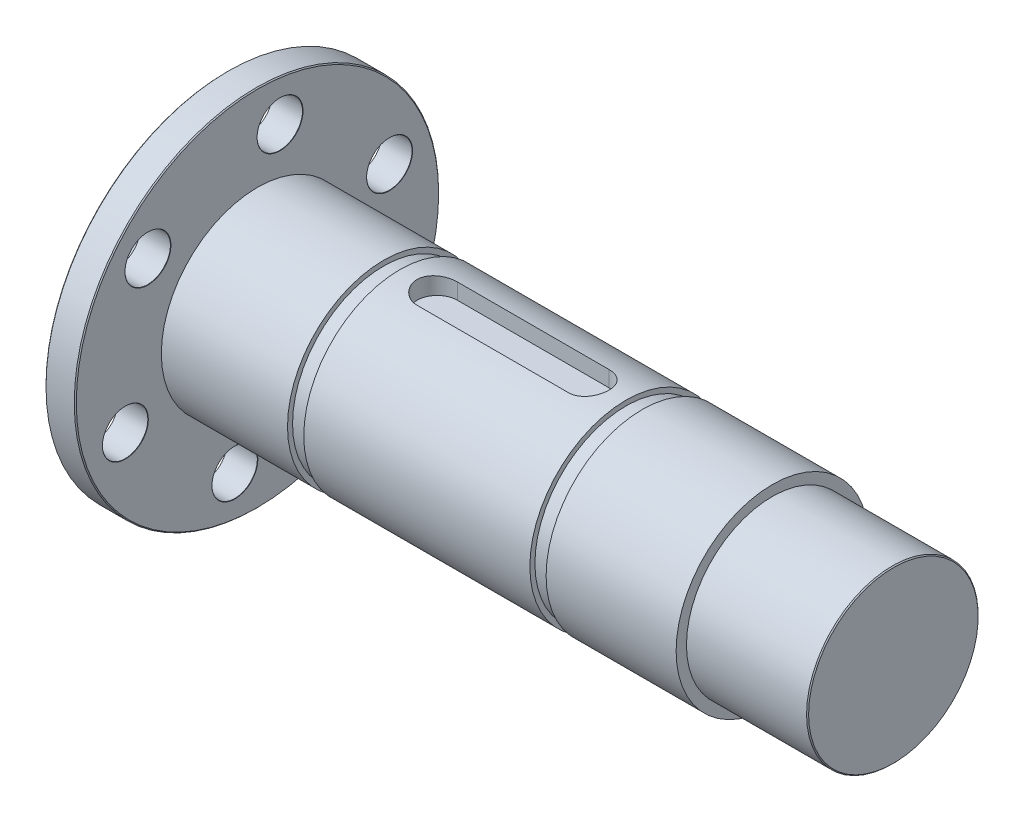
ISO-10303-21;
HEADER;
FILE_DESCRIPTION(('STEP AP214'),'2;1');
FILE_NAME('part.step','',(''),(''),'','','');
FILE_SCHEMA(('AUTOMOTIVE_DESIGN { 1 0 10303 214 1 1 1 1 }'));
ENDSEC;
DATA;
#1=APPLICATION_CONTEXT('core data for automotive mechanical design processes');
#2=APPLICATION_PROTOCOL_DEFINITION('international standard','automotive_design',2000,#1);
#3=PRODUCT_CONTEXT('',#1,'mechanical');
#4=PRODUCT('Part','Part','',(#3));
#5=PRODUCT_RELATED_PRODUCT_CATEGORY('part','',(#4));
#6=PRODUCT_DEFINITION_FORMATION('','',#4);
#7=PRODUCT_DEFINITION_CONTEXT('part definition',#1,'design');
#8=PRODUCT_DEFINITION('design','',#6,#7);
#9=PRODUCT_DEFINITION_SHAPE('','',#8);
#10=(LENGTH_UNIT() NAMED_UNIT(*) SI_UNIT(.MILLI.,.METRE.));
#11=(NAMED_UNIT(*) PLANE_ANGLE_UNIT() SI_UNIT($,.RADIAN.));
#12=(NAMED_UNIT(*) SI_UNIT($,.STERADIAN.) SOLID_ANGLE_UNIT());
#13=UNCERTAINTY_MEASURE_WITH_UNIT(LENGTH_MEASURE(1.E-05),#10,'distance_accuracy_value','');
#14=(GEOMETRIC_REPRESENTATION_CONTEXT(3) GLOBAL_UNCERTAINTY_ASSIGNED_CONTEXT((#13)) GLOBAL_UNIT_ASSIGNED_CONTEXT((#10,
#11,#12)) REPRESENTATION_CONTEXT('',''));
#15=CARTESIAN_POINT('',(0.,0.,0.));
#16=DIRECTION('',(0.,0.,1.));
#17=DIRECTION('',(1.,0.,0.));
#18=AXIS2_PLACEMENT_3D('',#15,#16,#17);
#19=CARTESIAN_POINT('',(42.9978723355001,13.5236372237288,0.));
#20=DIRECTION('',(-1.,0.,0.));
#21=DIRECTION('',(0.,0.,1.));
#22=AXIS2_PLACEMENT_3D('',#19,#20,#21);
#23=CYLINDRICAL_SURFACE('',#22,9.52418936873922);
#24=CARTESIAN_POINT('',(64.6078723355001,13.5236372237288,0.));
#25=DIRECTION('',(-1.,0.,0.));
#26=DIRECTION('',(0.,0.,1.));
#27=AXIS2_PLACEMENT_3D('',#24,#25,#26);
#28=CIRCLE('',#27,9.52418936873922);
#29=CARTESIAN_POINT('',(64.6078723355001,13.5236372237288,9.52418936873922));
#30=VERTEX_POINT('',#29);
#31=EDGE_CURVE('E224',#30,#30,#28,.T.);
#32=ORIENTED_EDGE('',*,*,#31,.F.);
#33=EDGE_LOOP('',(#32));
#34=FACE_BOUND('',#33,.T.);
#35=CARTESIAN_POINT('',(87.0078723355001,13.5236372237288,0.));
#36=DIRECTION('',(-1.,0.,0.));
#37=DIRECTION('',(0.,0.,1.));
#38=AXIS2_PLACEMENT_3D('',#35,#36,#37);
#39=CIRCLE('',#38,9.52418936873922);
#40=CARTESIAN_POINT('',(87.0078723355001,13.5236372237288,9.52418936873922));
#41=VERTEX_POINT('',#40);
#42=EDGE_CURVE('E228',#41,#41,#39,.T.);
#43=ORIENTED_EDGE('',*,*,#42,.T.);
#44=EDGE_LOOP('',(#43));
#45=FACE_BOUND('',#44,.T.);
#46=CARTESIAN_POINT('',(68.3076204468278,22.8354675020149,-2.));
#47=CARTESIAN_POINT('',(68.2520152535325,22.8354644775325,-2.00000036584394));
#48=CARTESIAN_POINT('',(68.1964373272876,22.8359662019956,-1.99767957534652));
#49=CARTESIAN_POINT('',(68.085691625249,22.8379476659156,-1.98842584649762));
#50=CARTESIAN_POINT('',(68.0305237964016,22.8394272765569,-1.98149351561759));
#51=CARTESIAN_POINT('',(67.8664195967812,22.8452762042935,-1.95386945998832));
#52=CARTESIAN_POINT('',(67.7586021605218,22.8510559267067,-1.9263503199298));
#53=CARTESIAN_POINT('',(67.5492495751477,22.8657123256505,-1.85395834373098));
#54=CARTESIAN_POINT('',(67.4477148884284,22.8745892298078,-1.80908423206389));
#55=CARTESIAN_POINT('',(67.2535805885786,22.8944351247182,-1.70329572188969));
#56=CARTESIAN_POINT('',(67.1609821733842,22.9054043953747,-1.64237917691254));
#57=CARTESIAN_POINT('',(66.9859568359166,22.9283876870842,-1.50523709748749));
#58=CARTESIAN_POINT('',(66.9036886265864,22.9404140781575,-1.42881113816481));
#59=CARTESIAN_POINT('',(66.7530327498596,22.9640491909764,-1.26324425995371));
#60=CARTESIAN_POINT('',(66.6846472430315,22.9756578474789,-1.17410136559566));
#61=CARTESIAN_POINT('',(66.5630814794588,22.9972835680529,-0.984570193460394));
#62=CARTESIAN_POINT('',(66.5100541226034,23.0072842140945,-0.88408181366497));
#63=CARTESIAN_POINT('',(66.4216999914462,23.0244261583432,-0.675381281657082));
#64=CARTESIAN_POINT('',(66.3863704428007,23.0315679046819,-0.567170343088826));
#65=CARTESIAN_POINT('',(66.3349112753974,23.0421000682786,-0.347752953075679));
#66=CARTESIAN_POINT('',(66.3185112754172,23.0455432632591,-0.23661248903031));
#67=CARTESIAN_POINT('',(66.3045321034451,23.0484729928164,-0.0131053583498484));
#68=CARTESIAN_POINT('',(66.3069513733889,23.0479598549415,0.0992612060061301));
#69=CARTESIAN_POINT('',(66.3303396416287,23.043075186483,0.320164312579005));
#70=CARTESIAN_POINT('',(66.3510168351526,23.0387643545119,0.428733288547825));
#71=CARTESIAN_POINT('',(66.4098698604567,23.0268375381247,0.640824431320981));
#72=CARTESIAN_POINT('',(66.4480463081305,23.0192214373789,0.744346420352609));
#73=CARTESIAN_POINT('',(66.5410786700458,23.0014409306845,0.944228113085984));
#74=CARTESIAN_POINT('',(66.5960472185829,22.9912594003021,1.0405338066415));
#75=CARTESIAN_POINT('',(66.7210182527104,22.9694677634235,1.22265838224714));
#76=CARTESIAN_POINT('',(66.7910221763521,22.9578575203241,1.30847625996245));
#77=CARTESIAN_POINT('',(66.9456610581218,22.9342258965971,1.4689164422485));
#78=CARTESIAN_POINT('',(67.0305497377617,22.9222008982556,1.54329383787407));
#79=CARTESIAN_POINT('',(67.2117453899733,22.8993006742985,1.67681926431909));
#80=CARTESIAN_POINT('',(67.3080554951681,22.8884257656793,1.7359631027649));
#81=CARTESIAN_POINT('',(67.5097494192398,22.8690466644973,1.83744200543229));
#82=CARTESIAN_POINT('',(67.6151604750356,22.8605499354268,1.87972432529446));
#83=CARTESIAN_POINT('',(67.8317442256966,22.8469962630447,1.94584630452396));
#84=CARTESIAN_POINT('',(67.9429080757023,22.8419341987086,1.96971342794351));
#85=CARTESIAN_POINT('',(68.0970825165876,22.8377519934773,1.98933824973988));
#86=CARTESIAN_POINT('',(68.1391226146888,22.8368963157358,1.99333767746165));
#87=CARTESIAN_POINT('',(68.2233089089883,22.8357545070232,1.99866525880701));
#88=CARTESIAN_POINT('',(68.2654548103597,22.8354674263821,1.99999786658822));
#89=CARTESIAN_POINT('',(68.3076204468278,22.8354675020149,2.));
#90=B_SPLINE_CURVE_WITH_KNOTS('',3,(#46,#47,#48,#49,#50,#51,#52,#53,#54,#55,#56,#57,#58,#59,#60,
#61,#62,#63,#64,#65,#66,#67,#68,#69,#70,#71,#72,#73,#74,#75,#76,#77,#78,#79,#80,#81,#82,#83,#84,
#85,#86,#87,#88,#89),.UNSPECIFIED.,.F.,.F.,(4,2,2,2,2,2,2,2,2,2,2,2,2,2,2,2,2,2,2,2,2,4),(0.,
0.166711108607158,0.333400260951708,0.665948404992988,0.998520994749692,1.33113810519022,
1.66836392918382,2.00564219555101,2.34617113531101,2.68664667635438,3.02219636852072,
3.35771828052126,3.68797290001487,4.01823914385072,4.35077121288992,4.68333510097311,
5.02224558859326,5.36124924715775,5.70130517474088,6.04085296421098,6.16750022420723,
6.29393577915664),.UNSPECIFIED.);
#91=CARTESIAN_POINT('',(68.3076204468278,22.8354675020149,-2.));
#92=VERTEX_POINT('',#91);
#93=CARTESIAN_POINT('',(68.3076204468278,22.8354675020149,2.));
#94=VERTEX_POINT('',#93);
#95=EDGE_CURVE('E72',#92,#94,#90,.T.);
#96=ORIENTED_EDGE('',*,*,#95,.F.);
#97=DIRECTION('',(-1.,0.,0.));
#98=VECTOR('',#97,1.);
#99=CARTESIAN_POINT('',(42.9978723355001,22.8354675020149,-2.));
#100=LINE('',#99,#98);
#101=CARTESIAN_POINT('',(83.3076204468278,22.8354675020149,-2.));
#102=VERTEX_POINT('',#101);
#103=EDGE_CURVE('E232',#102,#92,#100,.T.);
#104=ORIENTED_EDGE('',*,*,#103,.F.);
#105=CARTESIAN_POINT('',(83.3076204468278,22.8354675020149,2.));
#106=CARTESIAN_POINT('',(83.3632256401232,22.8354644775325,2.00000036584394));
#107=CARTESIAN_POINT('',(83.4188035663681,22.8359662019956,1.99767957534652));
#108=CARTESIAN_POINT('',(83.5295492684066,22.8379476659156,1.98842584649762));
#109=CARTESIAN_POINT('',(83.584717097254,22.8394272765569,1.98149351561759));
#110=CARTESIAN_POINT('',(83.7488212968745,22.8452762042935,1.95386945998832));
#111=CARTESIAN_POINT('',(83.8566387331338,22.8510559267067,1.9263503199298));
#112=CARTESIAN_POINT('',(84.065991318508,22.8657123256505,1.85395834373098));
#113=CARTESIAN_POINT('',(84.1675260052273,22.8745892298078,1.8090842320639));
#114=CARTESIAN_POINT('',(84.361660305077,22.8944351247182,1.70329572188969));
#115=CARTESIAN_POINT('',(84.4542587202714,22.9054043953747,1.64237917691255));
#116=CARTESIAN_POINT('',(84.629284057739,22.9283876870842,1.50523709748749));
#117=CARTESIAN_POINT('',(84.7115522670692,22.9404140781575,1.42881113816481));
#118=CARTESIAN_POINT('',(84.862208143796,22.9640491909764,1.26324425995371));
#119=CARTESIAN_POINT('',(84.9305936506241,22.9756578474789,1.17410136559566));
#120=CARTESIAN_POINT('',(85.0521594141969,22.9972835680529,0.984570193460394));
#121=CARTESIAN_POINT('',(85.1051867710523,23.0072842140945,0.88408181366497));
#122=CARTESIAN_POINT('',(85.1935409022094,23.0244261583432,0.675381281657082));
#123=CARTESIAN_POINT('',(85.228870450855,23.0315679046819,0.567170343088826));
#124=CARTESIAN_POINT('',(85.2803296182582,23.0421000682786,0.347752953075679));
#125=CARTESIAN_POINT('',(85.2967296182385,23.0455432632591,0.23661248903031));
#126=CARTESIAN_POINT('',(85.3107087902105,23.0484729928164,0.0131053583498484));
#127=CARTESIAN_POINT('',(85.3082895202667,23.0479598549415,-0.0992612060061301));
#128=CARTESIAN_POINT('',(85.284901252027,23.043075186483,-0.320164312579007));
#129=CARTESIAN_POINT('',(85.264224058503,23.0387643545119,-0.428733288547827));
#130=CARTESIAN_POINT('',(85.205371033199,23.0268375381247,-0.640824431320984));
#131=CARTESIAN_POINT('',(85.1671945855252,23.0192214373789,-0.744346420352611));
#132=CARTESIAN_POINT('',(85.0741622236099,23.0014409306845,-0.944228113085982));
#133=CARTESIAN_POINT('',(85.0191936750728,22.9912594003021,-1.04053380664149));
#134=CARTESIAN_POINT('',(84.8942226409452,22.9694677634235,-1.22265838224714));
#135=CARTESIAN_POINT('',(84.8242187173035,22.9578575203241,-1.30847625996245));
#136=CARTESIAN_POINT('',(84.6695798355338,22.9342258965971,-1.46891644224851));
#137=CARTESIAN_POINT('',(84.5846911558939,22.9222008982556,-1.54329383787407));
#138=CARTESIAN_POINT('',(84.4034955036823,22.8993006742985,-1.67681926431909));
#139=CARTESIAN_POINT('',(84.3071853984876,22.8884257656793,-1.7359631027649));
#140=CARTESIAN_POINT('',(84.1054914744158,22.8690466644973,-1.83744200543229));
#141=CARTESIAN_POINT('',(84.0000804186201,22.8605499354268,-1.87972432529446));
#142=CARTESIAN_POINT('',(83.783496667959,22.8469962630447,-1.94584630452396));
#143=CARTESIAN_POINT('',(83.6723328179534,22.8419341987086,-1.96971342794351));
#144=CARTESIAN_POINT('',(83.5181583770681,22.8377519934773,-1.98933824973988));
#145=CARTESIAN_POINT('',(83.4761182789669,22.8368963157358,-1.99333767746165));
#146=CARTESIAN_POINT('',(83.3919319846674,22.8357545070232,-1.99866525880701));
#147=CARTESIAN_POINT('',(83.349786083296,22.8354674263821,-1.99999786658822));
#148=CARTESIAN_POINT('',(83.3076204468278,22.8354675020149,-2.));
#149=B_SPLINE_CURVE_WITH_KNOTS('',3,(#105,#106,#107,#108,#109,#110,#111,#112,#113,#114,#115,
#116,#117,#118,#119,#120,#121,#122,#123,#124,#125,#126,#127,#128,#129,#130,#131,#132,#133,#134,
#135,#136,#137,#138,#139,#140,#141,#142,#143,#144,#145,#146,#147,#148),.UNSPECIFIED.,.F.,.F.,(4,
2,2,2,2,2,2,2,2,2,2,2,2,2,2,2,2,2,2,2,2,4),(0.,0.166711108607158,0.333400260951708,
0.665948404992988,0.998520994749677,1.33113810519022,1.66836392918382,2.00564219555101,
2.34617113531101,2.68664667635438,3.02219636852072,3.35771828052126,3.68797290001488,
4.01823914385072,4.35077121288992,4.68333510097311,5.02224558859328,5.36124924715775,
5.70130517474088,6.04085296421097,6.16750022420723,6.29393577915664),.UNSPECIFIED.);
#150=CARTESIAN_POINT('',(83.3076204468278,22.8354675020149,2.));
#151=VERTEX_POINT('',#150);
#152=EDGE_CURVE('E128',#151,#102,#149,.T.);
#153=ORIENTED_EDGE('',*,*,#152,.F.);
#154=DIRECTION('',(-1.,0.,0.));
#155=VECTOR('',#154,1.);
#156=CARTESIAN_POINT('',(42.9978723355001,22.8354675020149,2.));
#157=LINE('',#156,#155);
#158=EDGE_CURVE('E233',#94,#151,#157,.F.);
#159=ORIENTED_EDGE('',*,*,#158,.F.);
#160=EDGE_LOOP('',(#96,#104,#153,#159));
#161=FACE_BOUND('',#160,.T.);
#162=ADVANCED_FACE('F49',(#34,#45,#161),#23,.T.);
#163=CARTESIAN_POINT('',(42.9978723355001,0.,0.));
#164=DIRECTION('',(1.,0.,0.));
#165=DIRECTION('',(0.,0.,-1.));
#166=AXIS2_PLACEMENT_3D('',#163,#164,#165);
#167=PLANE('',#166);
#168=CARTESIAN_POINT('',(42.9978723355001,13.5236372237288,0.));
#169=DIRECTION('',(1.,0.,0.));
#170=DIRECTION('',(0.,0.,-1.));
#171=AXIS2_PLACEMENT_3D('',#168,#169,#170);
#172=CIRCLE('',#171,2.);
#173=CARTESIAN_POINT('',(42.9978723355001,13.5236372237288,-2.));
#174=VERTEX_POINT('',#173);
#175=EDGE_CURVE('E450',#174,#174,#172,.T.);
#176=ORIENTED_EDGE('',*,*,#175,.T.);
#177=EDGE_LOOP('',(#176));
#178=FACE_BOUND('',#177,.T.);
#179=CARTESIAN_POINT('',(42.9978723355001,13.5236372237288,0.));
#180=DIRECTION('',(-1.,0.,0.));
#181=DIRECTION('',(0.,0.,1.));
#182=AXIS2_PLACEMENT_3D('',#179,#180,#181);
#183=CIRCLE('',#182,10.5);
#184=CARTESIAN_POINT('',(42.9978723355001,13.5236372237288,10.5));
#185=VERTEX_POINT('',#184);
#186=EDGE_CURVE('E244',#185,#185,#183,.T.);
#187=ORIENTED_EDGE('',*,*,#186,.T.);
#188=EDGE_LOOP('',(#187));
#189=FACE_BOUND('',#188,.T.);
#190=ADVANCED_FACE('F212',(#178,#189),#167,.F.);
#191=CARTESIAN_POINT('',(42.9978723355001,13.5236372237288,0.));
#192=DIRECTION('',(-1.,0.,0.));
#193=DIRECTION('',(0.,0.,1.));
#194=AXIS2_PLACEMENT_3D('',#191,#192,#193);
#195=CYLINDRICAL_SURFACE('',#194,10.5);
#196=CARTESIAN_POINT('',(47.4978723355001,13.5236372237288,0.));
#197=DIRECTION('',(-1.,0.,0.));
#198=DIRECTION('',(0.,0.,1.));
#199=AXIS2_PLACEMENT_3D('',#196,#197,#198);
#200=CIRCLE('',#199,10.5);
#201=CARTESIAN_POINT('',(47.4978723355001,13.5236372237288,10.5));
#202=VERTEX_POINT('',#201);
#203=EDGE_CURVE('E404',#202,#202,#200,.T.);
#204=ORIENTED_EDGE('',*,*,#203,.T.);
#205=EDGE_LOOP('',(#204));
#206=FACE_BOUND('',#205,.T.);
#207=ORIENTED_EDGE('',*,*,#186,.F.);
#208=EDGE_LOOP('',(#207));
#209=FACE_BOUND('',#208,.T.);
#210=ADVANCED_FACE('F218',(#206,#209),#195,.T.);
#211=CARTESIAN_POINT('',(47.4978723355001,0.,0.));
#212=DIRECTION('',(-1.,0.,0.));
#213=DIRECTION('',(0.,0.,1.));
#214=AXIS2_PLACEMENT_3D('',#211,#212,#213);
#215=PLANE('',#214);
#216=CARTESIAN_POINT('',(47.4978723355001,22.3705459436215,10.850447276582));
#217=DIRECTION('',(-1.,0.,0.));
#218=DIRECTION('',(0.,0.,1.));
#219=AXIS2_PLACEMENT_3D('',#216,#217,#218);
#220=CIRCLE('',#219,2.24999999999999);
#221=CARTESIAN_POINT('',(47.4978723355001,22.3705459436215,13.100447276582));
#222=VERTEX_POINT('',#221);
#223=EDGE_CURVE('E54',#222,#222,#220,.T.);
#224=ORIENTED_EDGE('',*,*,#223,.F.);
#225=EDGE_LOOP('',(#224));
#226=FACE_BOUND('',#225,.T.);
#227=CARTESIAN_POINT('',(47.4978723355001,27.3438545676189,-2.23642405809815));
#228=DIRECTION('',(-1.,0.,0.));
#229=DIRECTION('',(0.,0.,1.));
#230=AXIS2_PLACEMENT_3D('',#227,#228,#229);
#231=CIRCLE('',#230,2.24999999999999);
#232=CARTESIAN_POINT('',(47.4978723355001,27.3438545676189,0.013575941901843));
#233=VERTEX_POINT('',#232);
#234=EDGE_CURVE('E279',#233,#233,#231,.T.);
#235=ORIENTED_EDGE('',*,*,#234,.F.);
#236=EDGE_LOOP('',(#235));
#237=FACE_BOUND('',#236,.T.);
#238=CARTESIAN_POINT('',(47.4978723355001,18.4969458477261,-13.0868713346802));
#239=DIRECTION('',(-1.,0.,0.));
#240=DIRECTION('',(0.,0.,1.));
#241=AXIS2_PLACEMENT_3D('',#238,#239,#240);
#242=CIRCLE('',#241,2.24999999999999);
#243=CARTESIAN_POINT('',(47.4978723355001,18.4969458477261,-10.8368713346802));
#244=VERTEX_POINT('',#243);
#245=EDGE_CURVE('E274',#244,#244,#242,.T.);
#246=ORIENTED_EDGE('',*,*,#245,.F.);
#247=EDGE_LOOP('',(#246));
#248=FACE_BOUND('',#247,.T.);
#249=CARTESIAN_POINT('',(47.4978723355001,4.67672850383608,-10.850447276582));
#250=DIRECTION('',(-1.,0.,0.));
#251=DIRECTION('',(0.,0.,1.));
#252=AXIS2_PLACEMENT_3D('',#249,#250,#251);
#253=CIRCLE('',#252,2.24999999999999);
#254=CARTESIAN_POINT('',(47.4978723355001,4.67672850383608,-8.60044727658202));
#255=VERTEX_POINT('',#254);
#256=EDGE_CURVE('E268',#255,#255,#253,.T.);
#257=ORIENTED_EDGE('',*,*,#256,.F.);
#258=EDGE_LOOP('',(#257));
#259=FACE_BOUND('',#258,.T.);
#260=CARTESIAN_POINT('',(47.4978723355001,-0.296580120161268,2.23642405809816));
#261=DIRECTION('',(-1.,0.,0.));
#262=DIRECTION('',(0.,0.,1.));
#263=AXIS2_PLACEMENT_3D('',#260,#261,#262);
#264=CIRCLE('',#263,2.24999999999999);
#265=CARTESIAN_POINT('',(47.4978723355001,-0.296580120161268,4.48642405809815));
#266=VERTEX_POINT('',#265);
#267=EDGE_CURVE('E262',#266,#266,#264,.T.);
#268=ORIENTED_EDGE('',*,*,#267,.F.);
#269=EDGE_LOOP('',(#268));
#270=FACE_BOUND('',#269,.T.);
#271=CARTESIAN_POINT('',(47.4978723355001,8.55032859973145,13.0868713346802));
#272=DIRECTION('',(-1.,0.,0.));
#273=DIRECTION('',(0.,0.,1.));
#274=AXIS2_PLACEMENT_3D('',#271,#272,#273);
#275=CIRCLE('',#274,2.24999999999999);
#276=CARTESIAN_POINT('',(47.4978723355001,8.55032859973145,15.3368713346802));
#277=VERTEX_POINT('',#276);
#278=EDGE_CURVE('E115',#277,#277,#275,.T.);
#279=ORIENTED_EDGE('',*,*,#278,.F.);
#280=EDGE_LOOP('',(#279));
#281=FACE_BOUND('',#280,.T.);
#282=CARTESIAN_POINT('',(47.4978723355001,13.5236372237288,0.));
#283=DIRECTION('',(-1.,0.,0.));
#284=DIRECTION('',(0.,0.,1.));
#285=AXIS2_PLACEMENT_3D('',#282,#283,#284);
#286=CIRCLE('',#285,17.95);
#287=CARTESIAN_POINT('',(47.4978723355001,13.5236372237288,17.95));
#288=VERTEX_POINT('',#287);
#289=EDGE_CURVE('E60',#288,#288,#286,.T.);
#290=ORIENTED_EDGE('',*,*,#289,.T.);
#291=EDGE_LOOP('',(#290));
#292=FACE_BOUND('',#291,.T.);
#293=ORIENTED_EDGE('',*,*,#203,.F.);
#294=EDGE_LOOP('',(#293));
#295=FACE_BOUND('',#294,.T.);
#296=ADVANCED_FACE('F386',(#226,#237,#248,#259,#270,#281,#292,#295),#215,.T.);
#297=CARTESIAN_POINT('',(42.9978723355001,13.5236372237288,0.));
#298=DIRECTION('',(-1.,0.,0.));
#299=DIRECTION('',(0.,0.,1.));
#300=AXIS2_PLACEMENT_3D('',#297,#298,#299);
#301=CYLINDRICAL_SURFACE('',#300,18.05);
#302=CARTESIAN_POINT('',(47.5978723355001,13.5236372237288,0.));
#303=DIRECTION('',(-1.,0.,0.));
#304=DIRECTION('',(0.,0.,1.));
#305=AXIS2_PLACEMENT_3D('',#302,#303,#304);
#306=CIRCLE('',#305,18.05);
#307=CARTESIAN_POINT('',(47.5978723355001,13.5236372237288,18.05));
#308=VERTEX_POINT('',#307);
#309=EDGE_CURVE('E11',#308,#308,#306,.F.);
#310=ORIENTED_EDGE('',*,*,#309,.T.);
#311=EDGE_LOOP('',(#310));
#312=FACE_BOUND('',#311,.T.);
#313=CARTESIAN_POINT('',(50.3978723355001,13.5236372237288,0.));
#314=DIRECTION('',(1.,0.,0.));
#315=DIRECTION('',(0.,0.,-1.));
#316=AXIS2_PLACEMENT_3D('',#313,#314,#315);
#317=CIRCLE('',#316,18.05);
#318=CARTESIAN_POINT('',(50.3978723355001,13.5236372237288,-18.05));
#319=VERTEX_POINT('',#318);
#320=EDGE_CURVE('E251',#319,#319,#317,.F.);
#321=ORIENTED_EDGE('',*,*,#320,.T.);
#322=EDGE_LOOP('',(#321));
#323=FACE_BOUND('',#322,.T.);
#324=ADVANCED_FACE('F389',(#312,#323),#301,.T.);
#325=CARTESIAN_POINT('',(50.4978723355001,0.,0.));
#326=DIRECTION('',(1.,0.,0.));
#327=DIRECTION('',(0.,0.,-1.));
#328=AXIS2_PLACEMENT_3D('',#325,#326,#327);
#329=PLANE('',#328);
#330=CARTESIAN_POINT('',(50.4978723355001,22.3705459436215,10.850447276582));
#331=DIRECTION('',(1.,0.,0.));
#332=DIRECTION('',(0.,0.,-1.));
#333=AXIS2_PLACEMENT_3D('',#330,#331,#332);
#334=CIRCLE('',#333,2.275);
#335=CARTESIAN_POINT('',(50.4978723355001,22.3705459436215,8.57544727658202));
#336=VERTEX_POINT('',#335);
#337=EDGE_CURVE('E376',#336,#336,#334,.T.);
#338=ORIENTED_EDGE('',*,*,#337,.F.);
#339=EDGE_LOOP('',(#338));
#340=FACE_BOUND('',#339,.T.);
#341=CARTESIAN_POINT('',(50.4978723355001,27.3438545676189,-2.23642405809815));
#342=DIRECTION('',(1.,0.,0.));
#343=DIRECTION('',(0.,0.,-1.));
#344=AXIS2_PLACEMENT_3D('',#341,#342,#343);
#345=CIRCLE('',#344,2.275);
#346=CARTESIAN_POINT('',(50.4978723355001,27.3438545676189,-4.51142405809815));
#347=VERTEX_POINT('',#346);
#348=EDGE_CURVE('E291',#347,#347,#345,.T.);
#349=ORIENTED_EDGE('',*,*,#348,.F.);
#350=EDGE_LOOP('',(#349));
#351=FACE_BOUND('',#350,.T.);
#352=CARTESIAN_POINT('',(50.4978723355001,18.4969458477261,-13.0868713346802));
#353=DIRECTION('',(1.,0.,0.));
#354=DIRECTION('',(0.,0.,-1.));
#355=AXIS2_PLACEMENT_3D('',#352,#353,#354);
#356=CIRCLE('',#355,2.275);
#357=CARTESIAN_POINT('',(50.4978723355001,18.4969458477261,-15.3618713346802));
#358=VERTEX_POINT('',#357);
#359=EDGE_CURVE('E282',#358,#358,#356,.T.);
#360=ORIENTED_EDGE('',*,*,#359,.F.);
#361=EDGE_LOOP('',(#360));
#362=FACE_BOUND('',#361,.T.);
#363=CARTESIAN_POINT('',(50.4978723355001,4.67672850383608,-10.850447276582));
#364=DIRECTION('',(1.,0.,0.));
#365=DIRECTION('',(0.,0.,-1.));
#366=AXIS2_PLACEMENT_3D('',#363,#364,#365);
#367=CIRCLE('',#366,2.275);
#368=CARTESIAN_POINT('',(50.4978723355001,4.67672850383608,-13.125447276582));
#369=VERTEX_POINT('',#368);
#370=EDGE_CURVE('E277',#369,#369,#367,.T.);
#371=ORIENTED_EDGE('',*,*,#370,.F.);
#372=EDGE_LOOP('',(#371));
#373=FACE_BOUND('',#372,.T.);
#374=CARTESIAN_POINT('',(50.4978723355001,-0.296580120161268,2.23642405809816));
#375=DIRECTION('',(1.,0.,0.));
#376=DIRECTION('',(0.,0.,-1.));
#377=AXIS2_PLACEMENT_3D('',#374,#375,#376);
#378=CIRCLE('',#377,2.275);
#379=CARTESIAN_POINT('',(50.4978723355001,-0.296580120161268,-0.0385759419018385));
#380=VERTEX_POINT('',#379);
#381=EDGE_CURVE('E272',#380,#380,#378,.T.);
#382=ORIENTED_EDGE('',*,*,#381,.F.);
#383=EDGE_LOOP('',(#382));
#384=FACE_BOUND('',#383,.T.);
#385=CARTESIAN_POINT('',(50.4978723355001,8.55032859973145,13.0868713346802));
#386=DIRECTION('',(1.,0.,0.));
#387=DIRECTION('',(0.,0.,-1.));
#388=AXIS2_PLACEMENT_3D('',#385,#386,#387);
#389=CIRCLE('',#388,2.275);
#390=CARTESIAN_POINT('',(50.4978723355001,8.55032859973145,10.8118713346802));
#391=VERTEX_POINT('',#390);
#392=EDGE_CURVE('E266',#391,#391,#389,.T.);
#393=ORIENTED_EDGE('',*,*,#392,.F.);
#394=EDGE_LOOP('',(#393));
#395=FACE_BOUND('',#394,.T.);
#396=CARTESIAN_POINT('',(50.4978723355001,13.5236372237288,0.));
#397=DIRECTION('',(1.,0.,0.));
#398=DIRECTION('',(0.,0.,-1.));
#399=AXIS2_PLACEMENT_3D('',#396,#397,#398);
#400=CIRCLE('',#399,17.95);
#401=CARTESIAN_POINT('',(50.4978723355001,13.5236372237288,-17.95));
#402=VERTEX_POINT('',#401);
#403=EDGE_CURVE('E255',#402,#402,#400,.T.);
#404=ORIENTED_EDGE('',*,*,#403,.T.);
#405=EDGE_LOOP('',(#404));
#406=FACE_BOUND('',#405,.T.);
#407=CARTESIAN_POINT('',(50.4978723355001,13.5236372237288,0.));
#408=DIRECTION('',(-1.,0.,0.));
#409=DIRECTION('',(0.,0.,1.));
#410=AXIS2_PLACEMENT_3D('',#407,#408,#409);
#411=CIRCLE('',#410,9.52418936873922);
#412=CARTESIAN_POINT('',(50.4978723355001,13.5236372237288,9.52418936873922));
#413=VERTEX_POINT('',#412);
#414=EDGE_CURVE('E407',#413,#413,#411,.T.);
#415=ORIENTED_EDGE('',*,*,#414,.T.);
#416=EDGE_LOOP('',(#415));
#417=FACE_BOUND('',#416,.T.);
#418=ADVANCED_FACE('F500',(#340,#351,#362,#373,#384,#395,#406,#417),#329,.T.);
#419=CARTESIAN_POINT('',(42.9978723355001,13.5236372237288,0.));
#420=DIRECTION('',(-1.,0.,0.));
#421=DIRECTION('',(0.,0.,1.));
#422=AXIS2_PLACEMENT_3D('',#419,#420,#421);
#423=CYLINDRICAL_SURFACE('',#422,9.52418936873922);
#424=ORIENTED_EDGE('',*,*,#414,.F.);
#425=EDGE_LOOP('',(#424));
#426=FACE_BOUND('',#425,.T.);
#427=CARTESIAN_POINT('',(62.9978723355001,13.5236372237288,0.));
#428=DIRECTION('',(-1.,0.,0.));
#429=DIRECTION('',(0.,0.,1.));
#430=AXIS2_PLACEMENT_3D('',#427,#428,#429);
#431=CIRCLE('',#430,9.52418936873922);
#432=CARTESIAN_POINT('',(62.9978723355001,13.5236372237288,9.52418936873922));
#433=VERTEX_POINT('',#432);
#434=EDGE_CURVE('E413',#433,#433,#431,.T.);
#435=ORIENTED_EDGE('',*,*,#434,.T.);
#436=EDGE_LOOP('',(#435));
#437=FACE_BOUND('',#436,.T.);
#438=ADVANCED_FACE('F505',(#426,#437),#423,.T.);
#439=CARTESIAN_POINT('',(62.9978723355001,0.,0.));
#440=DIRECTION('',(-1.,0.,0.));
#441=DIRECTION('',(0.,0.,1.));
#442=AXIS2_PLACEMENT_3D('',#439,#440,#441);
#443=PLANE('',#442);
#444=ORIENTED_EDGE('',*,*,#434,.F.);
#445=EDGE_LOOP('',(#444));
#446=FACE_BOUND('',#445,.T.);
#447=CARTESIAN_POINT('',(62.9978723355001,13.5236372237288,0.));
#448=DIRECTION('',(-1.,0.,0.));
#449=DIRECTION('',(0.,0.,1.));
#450=AXIS2_PLACEMENT_3D('',#447,#448,#449);
#451=CIRCLE('',#450,9.02418936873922);
#452=CARTESIAN_POINT('',(62.9978723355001,13.5236372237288,9.02418936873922));
#453=VERTEX_POINT('',#452);
#454=EDGE_CURVE('E419',#453,#453,#451,.T.);
#455=ORIENTED_EDGE('',*,*,#454,.T.);
#456=EDGE_LOOP('',(#455));
#457=FACE_BOUND('',#456,.T.);
#458=ADVANCED_FACE('F509',(#446,#457),#443,.F.);
#459=CARTESIAN_POINT('',(42.9978723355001,13.5236372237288,0.));
#460=DIRECTION('',(-1.,0.,0.));
#461=DIRECTION('',(0.,0.,1.));
#462=AXIS2_PLACEMENT_3D('',#459,#460,#461);
#463=CYLINDRICAL_SURFACE('',#462,9.02418936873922);
#464=ORIENTED_EDGE('',*,*,#454,.F.);
#465=EDGE_LOOP('',(#464));
#466=FACE_BOUND('',#465,.T.);
#467=CARTESIAN_POINT('',(64.6078723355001,13.5236372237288,0.));
#468=DIRECTION('',(-1.,0.,0.));
#469=DIRECTION('',(0.,0.,1.));
#470=AXIS2_PLACEMENT_3D('',#467,#468,#469);
#471=CIRCLE('',#470,9.02418936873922);
#472=CARTESIAN_POINT('',(64.6078723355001,13.5236372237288,9.02418936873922));
#473=VERTEX_POINT('',#472);
#474=EDGE_CURVE('E423',#473,#473,#471,.T.);
#475=ORIENTED_EDGE('',*,*,#474,.T.);
#476=EDGE_LOOP('',(#475));
#477=FACE_BOUND('',#476,.T.);
#478=ADVANCED_FACE('F207',(#466,#477),#463,.T.);
#479=CARTESIAN_POINT('',(64.6078723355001,1.79322868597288E-12,0.));
#480=DIRECTION('',(1.,0.,0.));
#481=DIRECTION('',(0.,0.,-1.));
#482=AXIS2_PLACEMENT_3D('',#479,#480,#481);
#483=PLANE('',#482);
#484=ORIENTED_EDGE('',*,*,#474,.F.);
#485=EDGE_LOOP('',(#484));
#486=FACE_BOUND('',#485,.T.);
#487=ORIENTED_EDGE('',*,*,#31,.T.);
#488=EDGE_LOOP('',(#487));
#489=FACE_BOUND('',#488,.T.);
#490=ADVANCED_FACE('F202',(#486,#489),#483,.F.);
#491=CARTESIAN_POINT('',(87.0078723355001,0.,0.));
#492=DIRECTION('',(1.,0.,0.));
#493=DIRECTION('',(0.,0.,-1.));
#494=AXIS2_PLACEMENT_3D('',#491,#492,#493);
#495=PLANE('',#494);
#496=CARTESIAN_POINT('',(87.0078723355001,13.5236372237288,0.));
#497=DIRECTION('',(-1.,0.,0.));
#498=DIRECTION('',(0.,0.,1.));
#499=AXIS2_PLACEMENT_3D('',#496,#497,#498);
#500=CIRCLE('',#499,9.02418936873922);
#501=CARTESIAN_POINT('',(87.0078723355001,13.5236372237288,9.02418936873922));
#502=VERTEX_POINT('',#501);
#503=EDGE_CURVE('E431',#502,#502,#500,.T.);
#504=ORIENTED_EDGE('',*,*,#503,.T.);
#505=EDGE_LOOP('',(#504));
#506=FACE_BOUND('',#505,.T.);
#507=ORIENTED_EDGE('',*,*,#42,.F.);
#508=EDGE_LOOP('',(#507));
#509=FACE_BOUND('',#508,.T.);
#510=ADVANCED_FACE('F199',(#506,#509),#495,.T.);
#511=CARTESIAN_POINT('',(42.9978723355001,13.5236372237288,0.));
#512=DIRECTION('',(-1.,0.,0.));
#513=DIRECTION('',(0.,0.,1.));
#514=AXIS2_PLACEMENT_3D('',#511,#512,#513);
#515=CYLINDRICAL_SURFACE('',#514,9.02418936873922);
#516=CARTESIAN_POINT('',(88.6178723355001,13.5236372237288,0.));
#517=DIRECTION('',(-1.,0.,0.));
#518=DIRECTION('',(0.,0.,1.));
#519=AXIS2_PLACEMENT_3D('',#516,#517,#518);
#520=CIRCLE('',#519,9.02418936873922);
#521=CARTESIAN_POINT('',(88.6178723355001,13.5236372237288,9.02418936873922));
#522=VERTEX_POINT('',#521);
#523=EDGE_CURVE('E434',#522,#522,#520,.T.);
#524=ORIENTED_EDGE('',*,*,#523,.T.);
#525=EDGE_LOOP('',(#524));
#526=FACE_BOUND('',#525,.T.);
#527=ORIENTED_EDGE('',*,*,#503,.F.);
#528=EDGE_LOOP('',(#527));
#529=FACE_BOUND('',#528,.T.);
#530=ADVANCED_FACE('F196',(#526,#529),#515,.T.);
#531=CARTESIAN_POINT('',(88.6178723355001,0.,0.));
#532=DIRECTION('',(-1.,0.,0.));
#533=DIRECTION('',(0.,0.,1.));
#534=AXIS2_PLACEMENT_3D('',#531,#532,#533);
#535=PLANE('',#534);
#536=CARTESIAN_POINT('',(88.6178723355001,13.5236372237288,0.));
#537=DIRECTION('',(-1.,0.,0.));
#538=DIRECTION('',(0.,0.,1.));
#539=AXIS2_PLACEMENT_3D('',#536,#537,#538);
#540=CIRCLE('',#539,9.52418936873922);
#541=CARTESIAN_POINT('',(88.6178723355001,13.5236372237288,9.52418936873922));
#542=VERTEX_POINT('',#541);
#543=EDGE_CURVE('E438',#542,#542,#540,.T.);
#544=ORIENTED_EDGE('',*,*,#543,.T.);
#545=EDGE_LOOP('',(#544));
#546=FACE_BOUND('',#545,.T.);
#547=ORIENTED_EDGE('',*,*,#523,.F.);
#548=EDGE_LOOP('',(#547));
#549=FACE_BOUND('',#548,.T.);
#550=ADVANCED_FACE('F192',(#546,#549),#535,.T.);
#551=CARTESIAN_POINT('',(42.9978723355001,13.5236372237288,0.));
#552=DIRECTION('',(-1.,0.,0.));
#553=DIRECTION('',(0.,0.,1.));
#554=AXIS2_PLACEMENT_3D('',#551,#552,#553);
#555=CYLINDRICAL_SURFACE('',#554,9.52418936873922);
#556=CARTESIAN_POINT('',(101.4978723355,13.5236372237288,0.));
#557=DIRECTION('',(-1.,0.,0.));
#558=DIRECTION('',(0.,0.,1.));
#559=AXIS2_PLACEMENT_3D('',#556,#557,#558);
#560=CIRCLE('',#559,9.52418936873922);
#561=CARTESIAN_POINT('',(101.4978723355,13.5236372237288,9.52418936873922));
#562=VERTEX_POINT('',#561);
#563=EDGE_CURVE('E442',#562,#562,#560,.T.);
#564=ORIENTED_EDGE('',*,*,#563,.T.);
#565=EDGE_LOOP('',(#564));
#566=FACE_BOUND('',#565,.T.);
#567=ORIENTED_EDGE('',*,*,#543,.F.);
#568=EDGE_LOOP('',(#567));
#569=FACE_BOUND('',#568,.T.);
#570=ADVANCED_FACE('F188',(#566,#569),#555,.T.);
#571=CARTESIAN_POINT('',(101.4978723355,0.,0.));
#572=DIRECTION('',(1.,0.,0.));
#573=DIRECTION('',(0.,0.,-1.));
#574=AXIS2_PLACEMENT_3D('',#571,#572,#573);
#575=PLANE('',#574);
#576=CARTESIAN_POINT('',(101.4978723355,13.5236372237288,0.));
#577=DIRECTION('',(-1.,0.,0.));
#578=DIRECTION('',(0.,0.,1.));
#579=AXIS2_PLACEMENT_3D('',#576,#577,#578);
#580=CIRCLE('',#579,8.5);
#581=CARTESIAN_POINT('',(101.4978723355,13.5236372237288,8.5));
#582=VERTEX_POINT('',#581);
#583=EDGE_CURVE('E446',#582,#582,#580,.T.);
#584=ORIENTED_EDGE('',*,*,#583,.T.);
#585=EDGE_LOOP('',(#584));
#586=FACE_BOUND('',#585,.T.);
#587=ORIENTED_EDGE('',*,*,#563,.F.);
#588=EDGE_LOOP('',(#587));
#589=FACE_BOUND('',#588,.T.);
#590=ADVANCED_FACE('F184',(#586,#589),#575,.T.);
#591=CARTESIAN_POINT('',(42.9978723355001,13.5236372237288,0.));
#592=DIRECTION('',(-1.,0.,0.));
#593=DIRECTION('',(0.,0.,1.));
#594=AXIS2_PLACEMENT_3D('',#591,#592,#593);
#595=CYLINDRICAL_SURFACE('',#594,8.5);
#596=CARTESIAN_POINT('',(113.3978723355,13.5236372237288,0.));
#597=DIRECTION('',(-1.,0.,0.));
#598=DIRECTION('',(0.,0.,1.));
#599=AXIS2_PLACEMENT_3D('',#596,#597,#598);
#600=CIRCLE('',#599,8.5);
#601=CARTESIAN_POINT('',(113.3978723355,13.5236372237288,8.5));
#602=VERTEX_POINT('',#601);
#603=EDGE_CURVE('E237',#602,#602,#600,.T.);
#604=ORIENTED_EDGE('',*,*,#603,.T.);
#605=EDGE_LOOP('',(#604));
#606=FACE_BOUND('',#605,.T.);
#607=ORIENTED_EDGE('',*,*,#583,.F.);
#608=EDGE_LOOP('',(#607));
#609=FACE_BOUND('',#608,.T.);
#610=ADVANCED_FACE('F180',(#606,#609),#595,.T.);
#611=CARTESIAN_POINT('',(113.4978723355,0.,0.));
#612=DIRECTION('',(-1.,0.,0.));
#613=DIRECTION('',(0.,0.,1.));
#614=AXIS2_PLACEMENT_3D('',#611,#612,#613);
#615=PLANE('',#614);
#616=CARTESIAN_POINT('',(113.4978723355,13.5236372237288,0.));
#617=DIRECTION('',(-1.,0.,0.));
#618=DIRECTION('',(0.,0.,1.));
#619=AXIS2_PLACEMENT_3D('',#616,#617,#618);
#620=CIRCLE('',#619,8.39999999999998);
#621=CARTESIAN_POINT('',(113.4978723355,13.5236372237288,8.39999999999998));
#622=VERTEX_POINT('',#621);
#623=EDGE_CURVE('E242',#622,#622,#620,.F.);
#624=ORIENTED_EDGE('',*,*,#623,.T.);
#625=EDGE_LOOP('',(#624));
#626=FACE_BOUND('',#625,.T.);
#627=ADVANCED_FACE('F176',(#626),#615,.F.);
#628=CARTESIAN_POINT('',(50.4978723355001,15.5486372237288,0.));
#629=DIRECTION('',(1.,0.,0.));
#630=DIRECTION('',(0.,0.,-1.));
#631=AXIS2_PLACEMENT_3D('',#628,#629,#630);
#632=PLANE('',#631);
#633=CARTESIAN_POINT('',(50.4978723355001,13.5236372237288,0.));
#634=DIRECTION('',(1.,0.,0.));
#635=DIRECTION('',(0.,0.,-1.));
#636=AXIS2_PLACEMENT_3D('',#633,#634,#635);
#637=CIRCLE('',#636,2.025);
#638=CARTESIAN_POINT('',(50.4978723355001,13.5236372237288,-2.025));
#639=VERTEX_POINT('',#638);
#640=EDGE_CURVE('E458',#639,#639,#637,.T.);
#641=ORIENTED_EDGE('',*,*,#640,.F.);
#642=EDGE_LOOP('',(#641));
#643=FACE_BOUND('',#642,.T.);
#644=ADVANCED_FACE('F172',(#643),#632,.F.);
#645=CARTESIAN_POINT('',(50.4978723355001,13.5236372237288,0.));
#646=DIRECTION('',(1.,0.,0.));
#647=DIRECTION('',(0.,0.,-1.));
#648=AXIS2_PLACEMENT_3D('',#645,#646,#647);
#649=CYLINDRICAL_SURFACE('',#648,2.);
#650=ORIENTED_EDGE('',*,*,#175,.F.);
#651=EDGE_LOOP('',(#650));
#652=FACE_BOUND('',#651,.T.);
#653=CARTESIAN_POINT('',(50.4728723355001,13.5236372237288,0.));
#654=DIRECTION('',(1.,0.,0.));
#655=DIRECTION('',(0.,0.,-1.));
#656=AXIS2_PLACEMENT_3D('',#653,#654,#655);
#657=CIRCLE('',#656,2.);
#658=CARTESIAN_POINT('',(50.4728723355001,13.5236372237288,-2.));
#659=VERTEX_POINT('',#658);
#660=EDGE_CURVE('E454',#659,#659,#657,.T.);
#661=ORIENTED_EDGE('',*,*,#660,.T.);
#662=EDGE_LOOP('',(#661));
#663=FACE_BOUND('',#662,.T.);
#664=ADVANCED_FACE('F168',(#652,#663),#649,.F.);
#665=CARTESIAN_POINT('',(50.4978723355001,13.5236372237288,0.));
#666=DIRECTION('',(1.,0.,0.));
#667=DIRECTION('',(0.,0.,-1.));
#668=AXIS2_PLACEMENT_3D('',#665,#666,#667);
#669=CONICAL_SURFACE('',#668,2.025,0.785398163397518);
#670=ORIENTED_EDGE('',*,*,#660,.F.);
#671=EDGE_LOOP('',(#670));
#672=FACE_BOUND('',#671,.T.);
#673=ORIENTED_EDGE('',*,*,#640,.T.);
#674=EDGE_LOOP('',(#673));
#675=FACE_BOUND('',#674,.T.);
#676=ADVANCED_FACE('F164',(#672,#675),#669,.F.);
#677=CARTESIAN_POINT('',(83.3076204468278,21.4232044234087,-2.));
#678=DIRECTION('',(0.,0.,1.));
#679=DIRECTION('',(1.,0.,0.));
#680=AXIS2_PLACEMENT_3D('',#677,#678,#679);
#681=PLANE('',#680);
#682=ORIENTED_EDGE('',*,*,#103,.T.);
#683=DIRECTION('',(0.,1.,0.));
#684=VECTOR('',#683,1.);
#685=CARTESIAN_POINT('',(68.3076204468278,21.4232044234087,-2.));
#686=LINE('',#685,#684);
#687=CARTESIAN_POINT('',(68.3076204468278,21.2632044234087,-2.));
#688=VERTEX_POINT('',#687);
#689=EDGE_CURVE('E68',#688,#92,#686,.T.);
#690=ORIENTED_EDGE('',*,*,#689,.F.);
#691=DIRECTION('',(-1.,0.,0.));
#692=VECTOR('',#691,1.);
#693=CARTESIAN_POINT('',(68.3076204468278,21.2632044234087,-2.));
#694=LINE('',#693,#692);
#695=CARTESIAN_POINT('',(83.3076204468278,21.2632044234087,-2.));
#696=VERTEX_POINT('',#695);
#697=EDGE_CURVE('E113',#696,#688,#694,.T.);
#698=ORIENTED_EDGE('',*,*,#697,.F.);
#699=DIRECTION('',(0.,1.,0.));
#700=VECTOR('',#699,1.);
#701=CARTESIAN_POINT('',(83.3076204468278,21.4232044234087,-2.));
#702=LINE('',#701,#700);
#703=EDGE_CURVE('E98',#696,#102,#702,.T.);
#704=ORIENTED_EDGE('',*,*,#703,.T.);
#705=EDGE_LOOP('',(#682,#690,#698,#704));
#706=FACE_BOUND('',#705,.T.);
#707=ADVANCED_FACE('F161',(#706),#681,.T.);
#708=CARTESIAN_POINT('',(83.3076204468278,21.4232044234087,2.));
#709=DIRECTION('',(0.,0.,-1.));
#710=DIRECTION('',(-1.,0.,0.));
#711=AXIS2_PLACEMENT_3D('',#708,#709,#710);
#712=PLANE('',#711);
#713=ORIENTED_EDGE('',*,*,#158,.T.);
#714=DIRECTION('',(0.,-1.,0.));
#715=VECTOR('',#714,1.);
#716=CARTESIAN_POINT('',(83.3076204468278,21.4232044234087,2.));
#717=LINE('',#716,#715);
#718=CARTESIAN_POINT('',(83.3076204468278,21.2632044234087,2.));
#719=VERTEX_POINT('',#718);
#720=EDGE_CURVE('E103',#151,#719,#717,.T.);
#721=ORIENTED_EDGE('',*,*,#720,.T.);
#722=DIRECTION('',(1.,0.,0.));
#723=VECTOR('',#722,1.);
#724=CARTESIAN_POINT('',(68.3076204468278,21.2632044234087,2.));
#725=LINE('',#724,#723);
#726=CARTESIAN_POINT('',(68.3076204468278,21.2632044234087,2.));
#727=VERTEX_POINT('',#726);
#728=EDGE_CURVE('E101',#727,#719,#725,.T.);
#729=ORIENTED_EDGE('',*,*,#728,.F.);
#730=DIRECTION('',(0.,-1.,0.));
#731=VECTOR('',#730,1.);
#732=CARTESIAN_POINT('',(68.3076204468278,21.4232044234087,2.));
#733=LINE('',#732,#731);
#734=EDGE_CURVE('E89',#94,#727,#733,.T.);
#735=ORIENTED_EDGE('',*,*,#734,.F.);
#736=EDGE_LOOP('',(#713,#721,#729,#735));
#737=FACE_BOUND('',#736,.T.);
#738=ADVANCED_FACE('F102',(#737),#712,.T.);
#739=CARTESIAN_POINT('',(113.3978723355,13.5236372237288,0.));
#740=DIRECTION('',(-1.,0.,0.));
#741=DIRECTION('',(0.,0.,1.));
#742=AXIS2_PLACEMENT_3D('',#739,#740,#741);
#743=CONICAL_SURFACE('',#742,8.5,0.785398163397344);
#744=ORIENTED_EDGE('',*,*,#623,.F.);
#745=EDGE_LOOP('',(#744));
#746=FACE_BOUND('',#745,.T.);
#747=ORIENTED_EDGE('',*,*,#603,.F.);
#748=EDGE_LOOP('',(#747));
#749=FACE_BOUND('',#748,.T.);
#750=ADVANCED_FACE('F160',(#746,#749),#743,.T.);
#751=CARTESIAN_POINT('',(50.3978723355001,13.5236372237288,0.));
#752=DIRECTION('',(-1.,0.,0.));
#753=DIRECTION('',(0.,0.,1.));
#754=AXIS2_PLACEMENT_3D('',#751,#752,#753);
#755=CONICAL_SURFACE('',#754,18.05,0.785398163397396);
#756=ORIENTED_EDGE('',*,*,#403,.F.);
#757=EDGE_LOOP('',(#756));
#758=FACE_BOUND('',#757,.T.);
#759=ORIENTED_EDGE('',*,*,#320,.F.);
#760=EDGE_LOOP('',(#759));
#761=FACE_BOUND('',#760,.T.);
#762=ADVANCED_FACE('F486',(#758,#761),#755,.T.);
#763=CARTESIAN_POINT('',(47.4978723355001,13.5236372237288,0.));
#764=DIRECTION('',(1.,0.,0.));
#765=DIRECTION('',(0.,0.,-1.));
#766=AXIS2_PLACEMENT_3D('',#763,#764,#765);
#767=CONICAL_SURFACE('',#766,17.95,0.785398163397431);
#768=ORIENTED_EDGE('',*,*,#309,.F.);
#769=EDGE_LOOP('',(#768));
#770=FACE_BOUND('',#769,.T.);
#771=ORIENTED_EDGE('',*,*,#289,.F.);
#772=EDGE_LOOP('',(#771));
#773=FACE_BOUND('',#772,.T.);
#774=ADVANCED_FACE('F52',(#770,#773),#767,.T.);
#775=CARTESIAN_POINT('',(68.3076204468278,23.1632044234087,0.));
#776=DIRECTION('',(0.,-1.,0.));
#777=DIRECTION('',(0.,0.,-1.));
#778=AXIS2_PLACEMENT_3D('',#775,#776,#777);
#779=CYLINDRICAL_SURFACE('',#778,2.);
#780=ORIENTED_EDGE('',*,*,#95,.T.);
#781=ORIENTED_EDGE('',*,*,#734,.T.);
#782=CARTESIAN_POINT('',(68.3076204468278,21.2632044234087,0.));
#783=DIRECTION('',(0.,1.,0.));
#784=DIRECTION('',(0.,0.,1.));
#785=AXIS2_PLACEMENT_3D('',#782,#783,#784);
#786=CIRCLE('',#785,2.);
#787=EDGE_CURVE('E93',#688,#727,#786,.T.);
#788=ORIENTED_EDGE('',*,*,#787,.F.);
#789=ORIENTED_EDGE('',*,*,#689,.T.);
#790=EDGE_LOOP('',(#780,#781,#788,#789));
#791=FACE_BOUND('',#790,.T.);
#792=ADVANCED_FACE('F91',(#791),#779,.F.);
#793=CARTESIAN_POINT('',(83.3076204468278,23.1632044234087,0.));
#794=DIRECTION('',(0.,-1.,0.));
#795=DIRECTION('',(0.,0.,-1.));
#796=AXIS2_PLACEMENT_3D('',#793,#794,#795);
#797=CYLINDRICAL_SURFACE('',#796,2.);
#798=ORIENTED_EDGE('',*,*,#152,.T.);
#799=ORIENTED_EDGE('',*,*,#703,.F.);
#800=CARTESIAN_POINT('',(83.3076204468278,21.2632044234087,0.));
#801=DIRECTION('',(0.,1.,0.));
#802=DIRECTION('',(0.,0.,-1.));
#803=AXIS2_PLACEMENT_3D('',#800,#801,#802);
#804=CIRCLE('',#803,2.);
#805=EDGE_CURVE('E108',#719,#696,#804,.T.);
#806=ORIENTED_EDGE('',*,*,#805,.F.);
#807=ORIENTED_EDGE('',*,*,#720,.F.);
#808=EDGE_LOOP('',(#798,#799,#806,#807));
#809=FACE_BOUND('',#808,.T.);
#810=ADVANCED_FACE('F146',(#809),#797,.F.);
#811=CARTESIAN_POINT('',(83.3076204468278,21.2632044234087,1.84));
#812=DIRECTION('',(0.,1.,0.));
#813=DIRECTION('',(0.,0.,1.));
#814=AXIS2_PLACEMENT_3D('',#811,#812,#813);
#815=PLANE('',#814);
#816=ORIENTED_EDGE('',*,*,#787,.T.);
#817=ORIENTED_EDGE('',*,*,#728,.T.);
#818=ORIENTED_EDGE('',*,*,#805,.T.);
#819=ORIENTED_EDGE('',*,*,#697,.T.);
#820=EDGE_LOOP('',(#816,#817,#818,#819));
#821=FACE_BOUND('',#820,.T.);
#822=ADVANCED_FACE('F111',(#821),#815,.T.);
#823=CARTESIAN_POINT('',(50.4978723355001,8.55032859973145,13.0868713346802));
#824=DIRECTION('',(1.,0.,0.));
#825=DIRECTION('',(0.,0.,-1.));
#826=AXIS2_PLACEMENT_3D('',#823,#824,#825);
#827=CYLINDRICAL_SURFACE('',#826,2.24999999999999);
#828=ORIENTED_EDGE('',*,*,#278,.T.);
#829=EDGE_LOOP('',(#828));
#830=FACE_BOUND('',#829,.T.);
#831=CARTESIAN_POINT('',(50.4728723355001,8.55032859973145,13.0868713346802));
#832=DIRECTION('',(1.,0.,0.));
#833=DIRECTION('',(0.,0.,-1.));
#834=AXIS2_PLACEMENT_3D('',#831,#832,#833);
#835=CIRCLE('',#834,2.25);
#836=CARTESIAN_POINT('',(50.4728723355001,8.55032859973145,10.8368713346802));
#837=VERTEX_POINT('',#836);
#838=EDGE_CURVE('E119',#837,#837,#835,.T.);
#839=ORIENTED_EDGE('',*,*,#838,.T.);
#840=EDGE_LOOP('',(#839));
#841=FACE_BOUND('',#840,.T.);
#842=ADVANCED_FACE('F151',(#830,#841),#827,.F.);
#843=CARTESIAN_POINT('',(50.4978723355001,8.55032859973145,13.0868713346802));
#844=DIRECTION('',(1.,0.,0.));
#845=DIRECTION('',(0.,0.,-1.));
#846=AXIS2_PLACEMENT_3D('',#843,#844,#845);
#847=CONICAL_SURFACE('',#846,2.275,0.785398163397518);
#848=ORIENTED_EDGE('',*,*,#838,.F.);
#849=EDGE_LOOP('',(#848));
#850=FACE_BOUND('',#849,.T.);
#851=ORIENTED_EDGE('',*,*,#392,.T.);
#852=EDGE_LOOP('',(#851));
#853=FACE_BOUND('',#852,.T.);
#854=ADVANCED_FACE('F323',(#850,#853),#847,.F.);
#855=CARTESIAN_POINT('',(50.4978723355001,-0.296580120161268,2.23642405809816));
#856=DIRECTION('',(1.,0.,0.));
#857=DIRECTION('',(0.,0.,-1.));
#858=AXIS2_PLACEMENT_3D('',#855,#856,#857);
#859=CYLINDRICAL_SURFACE('',#858,2.24999999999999);
#860=ORIENTED_EDGE('',*,*,#267,.T.);
#861=EDGE_LOOP('',(#860));
#862=FACE_BOUND('',#861,.T.);
#863=CARTESIAN_POINT('',(50.4728723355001,-0.296580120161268,2.23642405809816));
#864=DIRECTION('',(1.,0.,0.));
#865=DIRECTION('',(0.,0.,-1.));
#866=AXIS2_PLACEMENT_3D('',#863,#864,#865);
#867=CIRCLE('',#866,2.25);
#868=CARTESIAN_POINT('',(50.4728723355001,-0.296580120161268,-0.0135759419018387));
#869=VERTEX_POINT('',#868);
#870=EDGE_CURVE('E267',#869,#869,#867,.T.);
#871=ORIENTED_EDGE('',*,*,#870,.T.);
#872=EDGE_LOOP('',(#871));
#873=FACE_BOUND('',#872,.T.);
#874=ADVANCED_FACE('F325',(#862,#873),#859,.F.);
#875=CARTESIAN_POINT('',(50.4978723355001,-0.296580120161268,2.23642405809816));
#876=DIRECTION('',(1.,0.,0.));
#877=DIRECTION('',(0.,0.,-1.));
#878=AXIS2_PLACEMENT_3D('',#875,#876,#877);
#879=CONICAL_SURFACE('',#878,2.275,0.7853981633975);
#880=ORIENTED_EDGE('',*,*,#870,.F.);
#881=EDGE_LOOP('',(#880));
#882=FACE_BOUND('',#881,.T.);
#883=ORIENTED_EDGE('',*,*,#381,.T.);
#884=EDGE_LOOP('',(#883));
#885=FACE_BOUND('',#884,.T.);
#886=ADVANCED_FACE('F330',(#882,#885),#879,.F.);
#887=CARTESIAN_POINT('',(50.4978723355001,4.67672850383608,-10.850447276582));
#888=DIRECTION('',(1.,0.,0.));
#889=DIRECTION('',(0.,0.,-1.));
#890=AXIS2_PLACEMENT_3D('',#887,#888,#889);
#891=CYLINDRICAL_SURFACE('',#890,2.24999999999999);
#892=ORIENTED_EDGE('',*,*,#256,.T.);
#893=EDGE_LOOP('',(#892));
#894=FACE_BOUND('',#893,.T.);
#895=CARTESIAN_POINT('',(50.4728723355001,4.67672850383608,-10.850447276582));
#896=DIRECTION('',(1.,0.,0.));
#897=DIRECTION('',(0.,0.,-1.));
#898=AXIS2_PLACEMENT_3D('',#895,#896,#897);
#899=CIRCLE('',#898,2.25);
#900=CARTESIAN_POINT('',(50.4728723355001,4.67672850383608,-13.100447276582));
#901=VERTEX_POINT('',#900);
#902=EDGE_CURVE('E273',#901,#901,#899,.T.);
#903=ORIENTED_EDGE('',*,*,#902,.T.);
#904=EDGE_LOOP('',(#903));
#905=FACE_BOUND('',#904,.T.);
#906=ADVANCED_FACE('F337',(#894,#905),#891,.F.);
#907=CARTESIAN_POINT('',(50.4978723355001,4.67672850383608,-10.850447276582));
#908=DIRECTION('',(1.,0.,0.));
#909=DIRECTION('',(0.,0.,-1.));
#910=AXIS2_PLACEMENT_3D('',#907,#908,#909);
#911=CONICAL_SURFACE('',#910,2.275,0.7853981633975);
#912=ORIENTED_EDGE('',*,*,#902,.F.);
#913=EDGE_LOOP('',(#912));
#914=FACE_BOUND('',#913,.T.);
#915=ORIENTED_EDGE('',*,*,#370,.T.);
#916=EDGE_LOOP('',(#915));
#917=FACE_BOUND('',#916,.T.);
#918=ADVANCED_FACE('F341',(#914,#917),#911,.F.);
#919=CARTESIAN_POINT('',(50.4978723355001,18.4969458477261,-13.0868713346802));
#920=DIRECTION('',(1.,0.,0.));
#921=DIRECTION('',(0.,0.,-1.));
#922=AXIS2_PLACEMENT_3D('',#919,#920,#921);
#923=CYLINDRICAL_SURFACE('',#922,2.24999999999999);
#924=ORIENTED_EDGE('',*,*,#245,.T.);
#925=EDGE_LOOP('',(#924));
#926=FACE_BOUND('',#925,.T.);
#927=CARTESIAN_POINT('',(50.4728723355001,18.4969458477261,-13.0868713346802));
#928=DIRECTION('',(1.,0.,0.));
#929=DIRECTION('',(0.,0.,-1.));
#930=AXIS2_PLACEMENT_3D('',#927,#928,#929);
#931=CIRCLE('',#930,2.25);
#932=CARTESIAN_POINT('',(50.4728723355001,18.4969458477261,-15.3368713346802));
#933=VERTEX_POINT('',#932);
#934=EDGE_CURVE('E278',#933,#933,#931,.T.);
#935=ORIENTED_EDGE('',*,*,#934,.T.);
#936=EDGE_LOOP('',(#935));
#937=FACE_BOUND('',#936,.T.);
#938=ADVANCED_FACE('F345',(#926,#937),#923,.F.);
#939=CARTESIAN_POINT('',(50.4978723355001,18.4969458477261,-13.0868713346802));
#940=DIRECTION('',(1.,0.,0.));
#941=DIRECTION('',(0.,0.,-1.));
#942=AXIS2_PLACEMENT_3D('',#939,#940,#941);
#943=CONICAL_SURFACE('',#942,2.275,0.785398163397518);
#944=ORIENTED_EDGE('',*,*,#934,.F.);
#945=EDGE_LOOP('',(#944));
#946=FACE_BOUND('',#945,.T.);
#947=ORIENTED_EDGE('',*,*,#359,.T.);
#948=EDGE_LOOP('',(#947));
#949=FACE_BOUND('',#948,.T.);
#950=ADVANCED_FACE('F349',(#946,#949),#943,.F.);
#951=CARTESIAN_POINT('',(50.4978723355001,27.3438545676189,-2.23642405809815));
#952=DIRECTION('',(1.,0.,0.));
#953=DIRECTION('',(0.,0.,-1.));
#954=AXIS2_PLACEMENT_3D('',#951,#952,#953);
#955=CYLINDRICAL_SURFACE('',#954,2.24999999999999);
#956=ORIENTED_EDGE('',*,*,#234,.T.);
#957=EDGE_LOOP('',(#956));
#958=FACE_BOUND('',#957,.T.);
#959=CARTESIAN_POINT('',(50.4728723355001,27.3438545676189,-2.23642405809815));
#960=DIRECTION('',(1.,0.,0.));
#961=DIRECTION('',(0.,0.,-1.));
#962=AXIS2_PLACEMENT_3D('',#959,#960,#961);
#963=CIRCLE('',#962,2.25);
#964=CARTESIAN_POINT('',(50.4728723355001,27.3438545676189,-4.48642405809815));
#965=VERTEX_POINT('',#964);
#966=EDGE_CURVE('E283',#965,#965,#963,.T.);
#967=ORIENTED_EDGE('',*,*,#966,.T.);
#968=EDGE_LOOP('',(#967));
#969=FACE_BOUND('',#968,.T.);
#970=ADVANCED_FACE('F353',(#958,#969),#955,.F.);
#971=CARTESIAN_POINT('',(50.4978723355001,27.3438545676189,-2.23642405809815));
#972=DIRECTION('',(1.,0.,0.));
#973=DIRECTION('',(0.,0.,-1.));
#974=AXIS2_PLACEMENT_3D('',#971,#972,#973);
#975=CONICAL_SURFACE('',#974,2.275,0.785398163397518);
#976=ORIENTED_EDGE('',*,*,#966,.F.);
#977=EDGE_LOOP('',(#976));
#978=FACE_BOUND('',#977,.T.);
#979=ORIENTED_EDGE('',*,*,#348,.T.);
#980=EDGE_LOOP('',(#979));
#981=FACE_BOUND('',#980,.T.);
#982=ADVANCED_FACE('F357',(#978,#981),#975,.F.);
#983=CARTESIAN_POINT('',(50.4978723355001,22.3705459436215,10.850447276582));
#984=DIRECTION('',(1.,0.,0.));
#985=DIRECTION('',(0.,0.,-1.));
#986=AXIS2_PLACEMENT_3D('',#983,#984,#985);
#987=CYLINDRICAL_SURFACE('',#986,2.24999999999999);
#988=ORIENTED_EDGE('',*,*,#223,.T.);
#989=EDGE_LOOP('',(#988));
#990=FACE_BOUND('',#989,.T.);
#991=CARTESIAN_POINT('',(50.4728723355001,22.3705459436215,10.850447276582));
#992=DIRECTION('',(1.,0.,0.));
#993=DIRECTION('',(0.,0.,-1.));
#994=AXIS2_PLACEMENT_3D('',#991,#992,#993);
#995=CIRCLE('',#994,2.25);
#996=CARTESIAN_POINT('',(50.4728723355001,22.3705459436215,8.60044727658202));
#997=VERTEX_POINT('',#996);
#998=EDGE_CURVE('E373',#997,#997,#995,.T.);
#999=ORIENTED_EDGE('',*,*,#998,.T.);
#1000=EDGE_LOOP('',(#999));
#1001=FACE_BOUND('',#1000,.T.);
#1002=ADVANCED_FACE('F360',(#990,#1001),#987,.F.);
#1003=CARTESIAN_POINT('',(50.4978723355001,22.3705459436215,10.850447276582));
#1004=DIRECTION('',(1.,0.,0.));
#1005=DIRECTION('',(0.,0.,-1.));
#1006=AXIS2_PLACEMENT_3D('',#1003,#1004,#1005);
#1007=CONICAL_SURFACE('',#1006,2.275,0.785398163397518);
#1008=ORIENTED_EDGE('',*,*,#998,.F.);
#1009=EDGE_LOOP('',(#1008));
#1010=FACE_BOUND('',#1009,.T.);
#1011=ORIENTED_EDGE('',*,*,#337,.T.);
#1012=EDGE_LOOP('',(#1011));
#1013=FACE_BOUND('',#1012,.T.);
#1014=ADVANCED_FACE('F364',(#1010,#1013),#1007,.F.);
#1015=CLOSED_SHELL('',(#162,#190,#210,#296,#324,#418,#438,#458,#478,#490,#510,#530,#550,#570,
#590,#610,#627,#644,#664,#676,#707,#738,#750,#762,#774,#792,#810,#822,#842,#854,#874,#886,#906,
#918,#938,#950,#970,#982,#1002,#1014));
#1016=MANIFOLD_SOLID_BREP('B2',#1015);
#1017=ADVANCED_BREP_SHAPE_REPRESENTATION('',(#18,#1016),#14);
#1018=SHAPE_DEFINITION_REPRESENTATION(#9,#1017);
ENDSEC;
END-ISO-10303-21;
